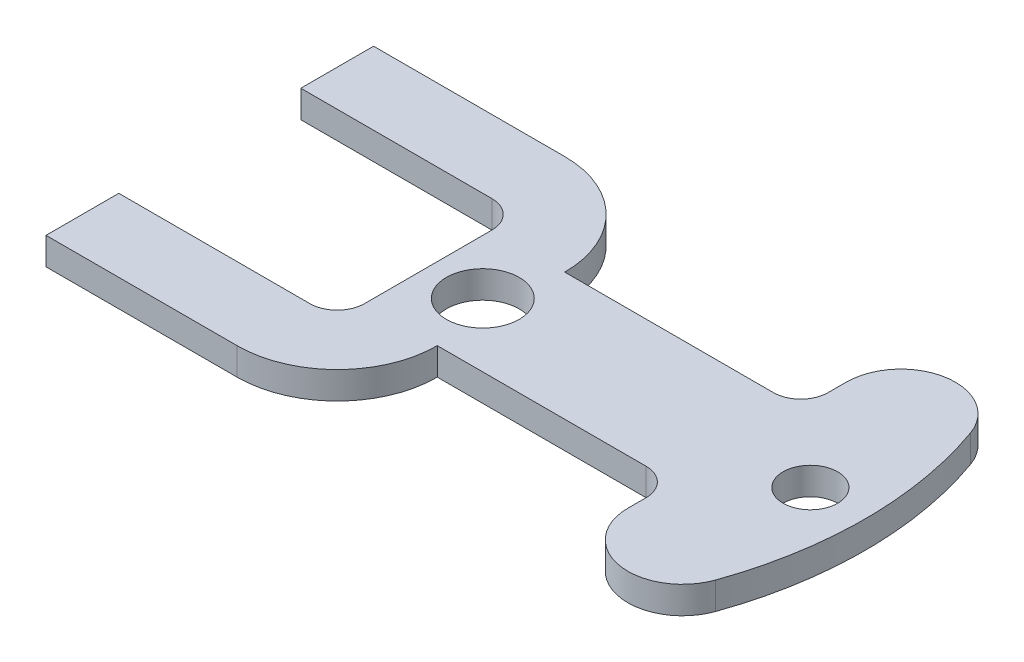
ISO-10303-21;
HEADER;
FILE_DESCRIPTION(('STEP AP214'),'2;1');
FILE_NAME('part.step','',(''),(''),'','','');
FILE_SCHEMA(('AUTOMOTIVE_DESIGN { 1 0 10303 214 1 1 1 1 }'));
ENDSEC;
DATA;
#1=APPLICATION_CONTEXT('core data for automotive mechanical design processes');
#2=APPLICATION_PROTOCOL_DEFINITION('international standard','automotive_design',2000,#1);
#3=PRODUCT_CONTEXT('',#1,'mechanical');
#4=PRODUCT('Part','Part','',(#3));
#5=PRODUCT_RELATED_PRODUCT_CATEGORY('part','',(#4));
#6=PRODUCT_DEFINITION_FORMATION('','',#4);
#7=PRODUCT_DEFINITION_CONTEXT('part definition',#1,'design');
#8=PRODUCT_DEFINITION('design','',#6,#7);
#9=PRODUCT_DEFINITION_SHAPE('','',#8);
#10=(LENGTH_UNIT() NAMED_UNIT(*) SI_UNIT(.MILLI.,.METRE.));
#11=(NAMED_UNIT(*) PLANE_ANGLE_UNIT() SI_UNIT($,.RADIAN.));
#12=(NAMED_UNIT(*) SI_UNIT($,.STERADIAN.) SOLID_ANGLE_UNIT());
#13=UNCERTAINTY_MEASURE_WITH_UNIT(LENGTH_MEASURE(1.E-05),#10,'distance_accuracy_value','');
#14=(GEOMETRIC_REPRESENTATION_CONTEXT(3) GLOBAL_UNCERTAINTY_ASSIGNED_CONTEXT((#13)) GLOBAL_UNIT_ASSIGNED_CONTEXT((#10,
#11,#12)) REPRESENTATION_CONTEXT('',''));
#15=CARTESIAN_POINT('',(0.,0.,0.));
#16=DIRECTION('',(0.,0.,1.));
#17=DIRECTION('',(1.,0.,0.));
#18=AXIS2_PLACEMENT_3D('',#15,#16,#17);
#19=CARTESIAN_POINT('',(24.9411254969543,3.,10.));
#20=DIRECTION('',(0.,-1.,0.));
#21=DIRECTION('',(0.,0.,-1.));
#22=AXIS2_PLACEMENT_3D('',#19,#20,#21);
#23=CYLINDRICAL_SURFACE('',#22,3.);
#24=CARTESIAN_POINT('',(24.9411254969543,0.,10.));
#25=DIRECTION('',(0.,1.,0.));
#26=DIRECTION('',(0.,0.,1.));
#27=AXIS2_PLACEMENT_3D('',#24,#25,#26);
#28=CIRCLE('',#27,3.);
#29=CARTESIAN_POINT('',(27.9411254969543,0.,10.));
#30=VERTEX_POINT('',#29);
#31=CARTESIAN_POINT('',(24.9411254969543,0.,7.));
#32=VERTEX_POINT('',#31);
#33=EDGE_CURVE('E205',#30,#32,#28,.T.);
#34=ORIENTED_EDGE('',*,*,#33,.F.);
#35=DIRECTION('',(0.,-1.,0.));
#36=VECTOR('',#35,1.);
#37=CARTESIAN_POINT('',(27.9411254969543,3.,10.));
#38=LINE('',#37,#36);
#39=CARTESIAN_POINT('',(27.9411254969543,3.,10.));
#40=VERTEX_POINT('',#39);
#41=EDGE_CURVE('E11',#40,#30,#38,.T.);
#42=ORIENTED_EDGE('',*,*,#41,.F.);
#43=CARTESIAN_POINT('',(24.9411254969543,3.,10.));
#44=DIRECTION('',(0.,1.,0.));
#45=DIRECTION('',(0.,0.,1.));
#46=AXIS2_PLACEMENT_3D('',#43,#44,#45);
#47=CIRCLE('',#46,3.);
#48=CARTESIAN_POINT('',(24.9411254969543,3.,7.));
#49=VERTEX_POINT('',#48);
#50=EDGE_CURVE('E257',#40,#49,#47,.T.);
#51=ORIENTED_EDGE('',*,*,#50,.T.);
#52=DIRECTION('',(0.,-1.,0.));
#53=VECTOR('',#52,1.);
#54=CARTESIAN_POINT('',(24.9411254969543,3.,7.));
#55=LINE('',#54,#53);
#56=EDGE_CURVE('E120',#49,#32,#55,.T.);
#57=ORIENTED_EDGE('',*,*,#56,.T.);
#58=EDGE_LOOP('',(#34,#42,#51,#57));
#59=FACE_BOUND('',#58,.T.);
#60=ADVANCED_FACE('F33',(#59),#23,.F.);
#61=CARTESIAN_POINT('',(27.9411254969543,3.,0.));
#62=DIRECTION('',(1.,0.,0.));
#63=DIRECTION('',(0.,0.,-1.));
#64=AXIS2_PLACEMENT_3D('',#61,#62,#63);
#65=PLANE('',#64);
#66=DIRECTION('',(0.,0.,1.));
#67=VECTOR('',#66,1.);
#68=CARTESIAN_POINT('',(27.9411254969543,0.,0.));
#69=LINE('',#68,#67);
#70=CARTESIAN_POINT('',(27.9411254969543,0.,12.));
#71=VERTEX_POINT('',#70);
#72=EDGE_CURVE('E208',#30,#71,#69,.T.);
#73=ORIENTED_EDGE('',*,*,#72,.T.);
#74=DIRECTION('',(0.,-1.,0.));
#75=VECTOR('',#74,1.);
#76=CARTESIAN_POINT('',(27.9411254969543,3.,12.));
#77=LINE('',#76,#75);
#78=CARTESIAN_POINT('',(27.9411254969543,3.,12.));
#79=VERTEX_POINT('',#78);
#80=EDGE_CURVE('E41',#79,#71,#77,.T.);
#81=ORIENTED_EDGE('',*,*,#80,.F.);
#82=DIRECTION('',(0.,0.,1.));
#83=VECTOR('',#82,1.);
#84=CARTESIAN_POINT('',(27.9411254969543,3.,0.));
#85=LINE('',#84,#83);
#86=EDGE_CURVE('E363',#40,#79,#85,.T.);
#87=ORIENTED_EDGE('',*,*,#86,.F.);
#88=ORIENTED_EDGE('',*,*,#41,.T.);
#89=EDGE_LOOP('',(#73,#81,#87,#88));
#90=FACE_BOUND('',#89,.T.);
#91=ADVANCED_FACE('F366',(#90),#65,.F.);
#92=CARTESIAN_POINT('',(33.9411254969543,3.,12.));
#93=DIRECTION('',(0.,-1.,0.));
#94=DIRECTION('',(0.,0.,-1.));
#95=AXIS2_PLACEMENT_3D('',#92,#93,#94);
#96=CYLINDRICAL_SURFACE('',#95,5.99999999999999);
#97=CARTESIAN_POINT('',(33.9411254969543,0.,12.));
#98=DIRECTION('',(0.,1.,0.));
#99=DIRECTION('',(0.,0.,1.));
#100=AXIS2_PLACEMENT_3D('',#97,#98,#99);
#101=CIRCLE('',#100,5.99999999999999);
#102=CARTESIAN_POINT('',(39.5979797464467,0.,14.));
#103=VERTEX_POINT('',#102);
#104=EDGE_CURVE('E210',#71,#103,#101,.T.);
#105=ORIENTED_EDGE('',*,*,#104,.T.);
#106=DIRECTION('',(0.,-1.,0.));
#107=VECTOR('',#106,1.);
#108=CARTESIAN_POINT('',(39.5979797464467,3.,14.));
#109=LINE('',#108,#107);
#110=CARTESIAN_POINT('',(39.5979797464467,3.,14.));
#111=VERTEX_POINT('',#110);
#112=EDGE_CURVE('E293',#111,#103,#109,.T.);
#113=ORIENTED_EDGE('',*,*,#112,.F.);
#114=CARTESIAN_POINT('',(33.9411254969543,3.,12.));
#115=DIRECTION('',(0.,1.,0.));
#116=DIRECTION('',(0.,0.,1.));
#117=AXIS2_PLACEMENT_3D('',#114,#115,#116);
#118=CIRCLE('',#117,5.99999999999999);
#119=EDGE_CURVE('E302',#79,#111,#118,.T.);
#120=ORIENTED_EDGE('',*,*,#119,.F.);
#121=ORIENTED_EDGE('',*,*,#80,.T.);
#122=EDGE_LOOP('',(#105,#113,#120,#121));
#123=FACE_BOUND('',#122,.T.);
#124=ADVANCED_FACE('F300',(#123),#96,.T.);
#125=CARTESIAN_POINT('',(0.,3.,0.));
#126=DIRECTION('',(0.,-1.,0.));
#127=DIRECTION('',(0.,0.,-1.));
#128=AXIS2_PLACEMENT_3D('',#125,#126,#127);
#129=CYLINDRICAL_SURFACE('',#128,42.);
#130=CARTESIAN_POINT('',(0.,0.,0.));
#131=DIRECTION('',(0.,1.,0.));
#132=DIRECTION('',(0.,0.,1.));
#133=AXIS2_PLACEMENT_3D('',#130,#131,#132);
#134=CIRCLE('',#133,42.);
#135=CARTESIAN_POINT('',(39.5979797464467,0.,-14.));
#136=VERTEX_POINT('',#135);
#137=EDGE_CURVE('E212',#103,#136,#134,.T.);
#138=ORIENTED_EDGE('',*,*,#137,.T.);
#139=DIRECTION('',(0.,-1.,0.));
#140=VECTOR('',#139,1.);
#141=CARTESIAN_POINT('',(39.5979797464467,3.,-14.));
#142=LINE('',#141,#140);
#143=CARTESIAN_POINT('',(39.5979797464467,3.,-14.));
#144=VERTEX_POINT('',#143);
#145=EDGE_CURVE('E290',#144,#136,#142,.T.);
#146=ORIENTED_EDGE('',*,*,#145,.F.);
#147=CARTESIAN_POINT('',(0.,3.,0.));
#148=DIRECTION('',(0.,1.,0.));
#149=DIRECTION('',(0.,0.,1.));
#150=AXIS2_PLACEMENT_3D('',#147,#148,#149);
#151=CIRCLE('',#150,42.);
#152=EDGE_CURVE('E322',#111,#144,#151,.T.);
#153=ORIENTED_EDGE('',*,*,#152,.F.);
#154=ORIENTED_EDGE('',*,*,#112,.T.);
#155=EDGE_LOOP('',(#138,#146,#153,#154));
#156=FACE_BOUND('',#155,.T.);
#157=ADVANCED_FACE('F313',(#156),#129,.T.);
#158=CARTESIAN_POINT('',(33.9411254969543,3.,-12.));
#159=DIRECTION('',(0.,-1.,0.));
#160=DIRECTION('',(0.,0.,-1.));
#161=AXIS2_PLACEMENT_3D('',#158,#159,#160);
#162=CYLINDRICAL_SURFACE('',#161,5.99999999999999);
#163=CARTESIAN_POINT('',(33.9411254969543,0.,-12.));
#164=DIRECTION('',(0.,1.,0.));
#165=DIRECTION('',(0.,0.,1.));
#166=AXIS2_PLACEMENT_3D('',#163,#164,#165);
#167=CIRCLE('',#166,5.99999999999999);
#168=CARTESIAN_POINT('',(27.9411254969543,0.,-12.));
#169=VERTEX_POINT('',#168);
#170=EDGE_CURVE('E214',#136,#169,#167,.T.);
#171=ORIENTED_EDGE('',*,*,#170,.T.);
#172=DIRECTION('',(0.,-1.,0.));
#173=VECTOR('',#172,1.);
#174=CARTESIAN_POINT('',(27.9411254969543,3.,-12.));
#175=LINE('',#174,#173);
#176=CARTESIAN_POINT('',(27.9411254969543,3.,-12.));
#177=VERTEX_POINT('',#176);
#178=EDGE_CURVE('E287',#177,#169,#175,.T.);
#179=ORIENTED_EDGE('',*,*,#178,.F.);
#180=CARTESIAN_POINT('',(33.9411254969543,3.,-12.));
#181=DIRECTION('',(0.,1.,0.));
#182=DIRECTION('',(0.,0.,1.));
#183=AXIS2_PLACEMENT_3D('',#180,#181,#182);
#184=CIRCLE('',#183,5.99999999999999);
#185=EDGE_CURVE('E319',#144,#177,#184,.T.);
#186=ORIENTED_EDGE('',*,*,#185,.F.);
#187=ORIENTED_EDGE('',*,*,#145,.T.);
#188=EDGE_LOOP('',(#171,#179,#186,#187));
#189=FACE_BOUND('',#188,.T.);
#190=ADVANCED_FACE('F317',(#189),#162,.T.);
#191=CARTESIAN_POINT('',(27.9411254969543,3.,0.));
#192=DIRECTION('',(1.,0.,0.));
#193=DIRECTION('',(0.,0.,-1.));
#194=AXIS2_PLACEMENT_3D('',#191,#192,#193);
#195=PLANE('',#194);
#196=DIRECTION('',(0.,0.,1.));
#197=VECTOR('',#196,1.);
#198=CARTESIAN_POINT('',(27.9411254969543,0.,0.));
#199=LINE('',#198,#197);
#200=CARTESIAN_POINT('',(27.9411254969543,0.,-10.));
#201=VERTEX_POINT('',#200);
#202=EDGE_CURVE('E216',#169,#201,#199,.T.);
#203=ORIENTED_EDGE('',*,*,#202,.T.);
#204=DIRECTION('',(0.,-1.,0.));
#205=VECTOR('',#204,1.);
#206=CARTESIAN_POINT('',(27.9411254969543,3.,-10.));
#207=LINE('',#206,#205);
#208=CARTESIAN_POINT('',(27.9411254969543,3.,-10.));
#209=VERTEX_POINT('',#208);
#210=EDGE_CURVE('E285',#209,#201,#207,.T.);
#211=ORIENTED_EDGE('',*,*,#210,.F.);
#212=DIRECTION('',(0.,0.,1.));
#213=VECTOR('',#212,1.);
#214=CARTESIAN_POINT('',(27.9411254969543,3.,0.));
#215=LINE('',#214,#213);
#216=EDGE_CURVE('E321',#177,#209,#215,.T.);
#217=ORIENTED_EDGE('',*,*,#216,.F.);
#218=ORIENTED_EDGE('',*,*,#178,.T.);
#219=EDGE_LOOP('',(#203,#211,#217,#218));
#220=FACE_BOUND('',#219,.T.);
#221=ADVANCED_FACE('F378',(#220),#195,.F.);
#222=CARTESIAN_POINT('',(24.9411254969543,3.,-10.));
#223=DIRECTION('',(0.,-1.,0.));
#224=DIRECTION('',(0.,0.,-1.));
#225=AXIS2_PLACEMENT_3D('',#222,#223,#224);
#226=CYLINDRICAL_SURFACE('',#225,3.);
#227=CARTESIAN_POINT('',(24.9411254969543,0.,-10.));
#228=DIRECTION('',(0.,1.,0.));
#229=DIRECTION('',(0.,0.,1.));
#230=AXIS2_PLACEMENT_3D('',#227,#228,#229);
#231=CIRCLE('',#230,3.);
#232=CARTESIAN_POINT('',(24.9411254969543,0.,-7.));
#233=VERTEX_POINT('',#232);
#234=EDGE_CURVE('E219',#233,#201,#231,.T.);
#235=ORIENTED_EDGE('',*,*,#234,.F.);
#236=DIRECTION('',(0.,-1.,0.));
#237=VECTOR('',#236,1.);
#238=CARTESIAN_POINT('',(24.9411254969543,3.,-7.));
#239=LINE('',#238,#237);
#240=CARTESIAN_POINT('',(24.9411254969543,3.,-7.));
#241=VERTEX_POINT('',#240);
#242=EDGE_CURVE('E283',#241,#233,#239,.T.);
#243=ORIENTED_EDGE('',*,*,#242,.F.);
#244=CARTESIAN_POINT('',(24.9411254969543,3.,-10.));
#245=DIRECTION('',(0.,1.,0.));
#246=DIRECTION('',(0.,0.,1.));
#247=AXIS2_PLACEMENT_3D('',#244,#245,#246);
#248=CIRCLE('',#247,3.);
#249=EDGE_CURVE('E324',#241,#209,#248,.T.);
#250=ORIENTED_EDGE('',*,*,#249,.T.);
#251=ORIENTED_EDGE('',*,*,#210,.T.);
#252=EDGE_LOOP('',(#235,#243,#250,#251));
#253=FACE_BOUND('',#252,.T.);
#254=ADVANCED_FACE('F381',(#253),#226,.F.);
#255=CARTESIAN_POINT('',(-56.7545190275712,3.,-7.));
#256=DIRECTION('',(0.,0.,-1.));
#257=DIRECTION('',(-1.,0.,0.));
#258=AXIS2_PLACEMENT_3D('',#255,#256,#257);
#259=PLANE('',#258);
#260=DIRECTION('',(1.,0.,0.));
#261=VECTOR('',#260,1.);
#262=CARTESIAN_POINT('',(-56.7545190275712,0.,-7.));
#263=LINE('',#262,#261);
#264=CARTESIAN_POINT('',(2.00000000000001,0.,-7.));
#265=VERTEX_POINT('',#264);
#266=EDGE_CURVE('E222',#265,#233,#263,.T.);
#267=ORIENTED_EDGE('',*,*,#266,.F.);
#268=DIRECTION('',(0.,-1.,0.));
#269=VECTOR('',#268,1.);
#270=CARTESIAN_POINT('',(2.00000000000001,3.,-7.));
#271=LINE('',#270,#269);
#272=CARTESIAN_POINT('',(2.00000000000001,3.,-7.));
#273=VERTEX_POINT('',#272);
#274=EDGE_CURVE('E281',#273,#265,#271,.T.);
#275=ORIENTED_EDGE('',*,*,#274,.F.);
#276=DIRECTION('',(1.,0.,0.));
#277=VECTOR('',#276,1.);
#278=CARTESIAN_POINT('',(-56.7545190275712,3.,-7.));
#279=LINE('',#278,#277);
#280=EDGE_CURVE('E331',#273,#241,#279,.T.);
#281=ORIENTED_EDGE('',*,*,#280,.T.);
#282=ORIENTED_EDGE('',*,*,#242,.T.);
#283=EDGE_LOOP('',(#267,#275,#281,#282));
#284=FACE_BOUND('',#283,.T.);
#285=ADVANCED_FACE('F385',(#284),#259,.T.);
#286=CARTESIAN_POINT('',(-9.,3.,-7.));
#287=DIRECTION('',(0.,-1.,0.));
#288=DIRECTION('',(0.,0.,-1.));
#289=AXIS2_PLACEMENT_3D('',#286,#287,#288);
#290=CYLINDRICAL_SURFACE('',#289,11.);
#291=CARTESIAN_POINT('',(-9.,0.,-7.));
#292=DIRECTION('',(0.,1.,0.));
#293=DIRECTION('',(0.,0.,1.));
#294=AXIS2_PLACEMENT_3D('',#291,#292,#293);
#295=CIRCLE('',#294,11.);
#296=CARTESIAN_POINT('',(-9.,0.,-18.));
#297=VERTEX_POINT('',#296);
#298=EDGE_CURVE('E225',#265,#297,#295,.T.);
#299=ORIENTED_EDGE('',*,*,#298,.T.);
#300=DIRECTION('',(0.,-1.,0.));
#301=VECTOR('',#300,1.);
#302=CARTESIAN_POINT('',(-9.,3.,-18.));
#303=LINE('',#302,#301);
#304=CARTESIAN_POINT('',(-9.,3.,-18.));
#305=VERTEX_POINT('',#304);
#306=EDGE_CURVE('E278',#305,#297,#303,.T.);
#307=ORIENTED_EDGE('',*,*,#306,.F.);
#308=CARTESIAN_POINT('',(-9.,3.,-7.));
#309=DIRECTION('',(0.,1.,0.));
#310=DIRECTION('',(0.,0.,1.));
#311=AXIS2_PLACEMENT_3D('',#308,#309,#310);
#312=CIRCLE('',#311,11.);
#313=EDGE_CURVE('E334',#273,#305,#312,.T.);
#314=ORIENTED_EDGE('',*,*,#313,.F.);
#315=ORIENTED_EDGE('',*,*,#274,.T.);
#316=EDGE_LOOP('',(#299,#307,#314,#315));
#317=FACE_BOUND('',#316,.T.);
#318=ADVANCED_FACE('F389',(#317),#290,.T.);
#319=CARTESIAN_POINT('',(-56.7545190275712,3.,-18.));
#320=DIRECTION('',(0.,0.,1.));
#321=DIRECTION('',(1.,0.,0.));
#322=AXIS2_PLACEMENT_3D('',#319,#320,#321);
#323=PLANE('',#322);
#324=DIRECTION('',(-1.,0.,0.));
#325=VECTOR('',#324,1.);
#326=CARTESIAN_POINT('',(-56.7545190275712,0.,-18.));
#327=LINE('',#326,#325);
#328=CARTESIAN_POINT('',(-30.,0.,-18.));
#329=VERTEX_POINT('',#328);
#330=EDGE_CURVE('E227',#297,#329,#327,.T.);
#331=ORIENTED_EDGE('',*,*,#330,.T.);
#332=DIRECTION('',(0.,-1.,0.));
#333=VECTOR('',#332,1.);
#334=CARTESIAN_POINT('',(-30.,3.,-18.));
#335=LINE('',#334,#333);
#336=CARTESIAN_POINT('',(-30.,3.,-18.));
#337=VERTEX_POINT('',#336);
#338=EDGE_CURVE('E275',#337,#329,#335,.T.);
#339=ORIENTED_EDGE('',*,*,#338,.F.);
#340=DIRECTION('',(-1.,0.,0.));
#341=VECTOR('',#340,1.);
#342=CARTESIAN_POINT('',(-56.7545190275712,3.,-18.));
#343=LINE('',#342,#341);
#344=EDGE_CURVE('E336',#305,#337,#343,.T.);
#345=ORIENTED_EDGE('',*,*,#344,.F.);
#346=ORIENTED_EDGE('',*,*,#306,.T.);
#347=EDGE_LOOP('',(#331,#339,#345,#346));
#348=FACE_BOUND('',#347,.T.);
#349=ADVANCED_FACE('F393',(#348),#323,.F.);
#350=CARTESIAN_POINT('',(-30.,3.,0.));
#351=DIRECTION('',(1.,0.,0.));
#352=DIRECTION('',(0.,0.,-1.));
#353=AXIS2_PLACEMENT_3D('',#350,#351,#352);
#354=PLANE('',#353);
#355=DIRECTION('',(0.,0.,1.));
#356=VECTOR('',#355,1.);
#357=CARTESIAN_POINT('',(-30.,0.,0.));
#358=LINE('',#357,#356);
#359=CARTESIAN_POINT('',(-30.,0.,-10.));
#360=VERTEX_POINT('',#359);
#361=EDGE_CURVE('E229',#329,#360,#358,.T.);
#362=ORIENTED_EDGE('',*,*,#361,.T.);
#363=DIRECTION('',(0.,-1.,0.));
#364=VECTOR('',#363,1.);
#365=CARTESIAN_POINT('',(-30.,3.,-10.));
#366=LINE('',#365,#364);
#367=CARTESIAN_POINT('',(-30.,3.,-10.));
#368=VERTEX_POINT('',#367);
#369=EDGE_CURVE('E272',#368,#360,#366,.T.);
#370=ORIENTED_EDGE('',*,*,#369,.F.);
#371=DIRECTION('',(0.,0.,1.));
#372=VECTOR('',#371,1.);
#373=CARTESIAN_POINT('',(-30.,3.,0.));
#374=LINE('',#373,#372);
#375=EDGE_CURVE('E338',#337,#368,#374,.T.);
#376=ORIENTED_EDGE('',*,*,#375,.F.);
#377=ORIENTED_EDGE('',*,*,#338,.T.);
#378=EDGE_LOOP('',(#362,#370,#376,#377));
#379=FACE_BOUND('',#378,.T.);
#380=ADVANCED_FACE('F397',(#379),#354,.F.);
#381=CARTESIAN_POINT('',(-56.7545190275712,3.,-10.));
#382=DIRECTION('',(0.,0.,-1.));
#383=DIRECTION('',(-1.,0.,0.));
#384=AXIS2_PLACEMENT_3D('',#381,#382,#383);
#385=PLANE('',#384);
#386=DIRECTION('',(1.,0.,0.));
#387=VECTOR('',#386,1.);
#388=CARTESIAN_POINT('',(-56.7545190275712,0.,-10.));
#389=LINE('',#388,#387);
#390=CARTESIAN_POINT('',(-9.00000000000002,0.,-10.));
#391=VERTEX_POINT('',#390);
#392=EDGE_CURVE('E231',#360,#391,#389,.T.);
#393=ORIENTED_EDGE('',*,*,#392,.T.);
#394=DIRECTION('',(0.,-1.,0.));
#395=VECTOR('',#394,1.);
#396=CARTESIAN_POINT('',(-9.00000000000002,3.,-10.));
#397=LINE('',#396,#395);
#398=CARTESIAN_POINT('',(-9.00000000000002,3.,-10.));
#399=VERTEX_POINT('',#398);
#400=EDGE_CURVE('E270',#399,#391,#397,.T.);
#401=ORIENTED_EDGE('',*,*,#400,.F.);
#402=DIRECTION('',(1.,0.,0.));
#403=VECTOR('',#402,1.);
#404=CARTESIAN_POINT('',(-56.7545190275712,3.,-10.));
#405=LINE('',#404,#403);
#406=EDGE_CURVE('E340',#368,#399,#405,.T.);
#407=ORIENTED_EDGE('',*,*,#406,.F.);
#408=ORIENTED_EDGE('',*,*,#369,.T.);
#409=EDGE_LOOP('',(#393,#401,#407,#408));
#410=FACE_BOUND('',#409,.T.);
#411=ADVANCED_FACE('F401',(#410),#385,.F.);
#412=CARTESIAN_POINT('',(-9.,3.,-7.));
#413=DIRECTION('',(0.,-1.,0.));
#414=DIRECTION('',(0.,0.,-1.));
#415=AXIS2_PLACEMENT_3D('',#412,#413,#414);
#416=CYLINDRICAL_SURFACE('',#415,3.);
#417=CARTESIAN_POINT('',(-9.,0.,-7.));
#418=DIRECTION('',(0.,1.,0.));
#419=DIRECTION('',(0.,0.,1.));
#420=AXIS2_PLACEMENT_3D('',#417,#418,#419);
#421=CIRCLE('',#420,3.);
#422=CARTESIAN_POINT('',(-6.,0.,-6.99999999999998));
#423=VERTEX_POINT('',#422);
#424=EDGE_CURVE('E234',#423,#391,#421,.T.);
#425=ORIENTED_EDGE('',*,*,#424,.F.);
#426=DIRECTION('',(0.,-1.,0.));
#427=VECTOR('',#426,1.);
#428=CARTESIAN_POINT('',(-6.,3.,-6.99999999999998));
#429=LINE('',#428,#427);
#430=CARTESIAN_POINT('',(-6.,3.,-6.99999999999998));
#431=VERTEX_POINT('',#430);
#432=EDGE_CURVE('E268',#431,#423,#429,.T.);
#433=ORIENTED_EDGE('',*,*,#432,.F.);
#434=CARTESIAN_POINT('',(-9.,3.,-7.));
#435=DIRECTION('',(0.,1.,0.));
#436=DIRECTION('',(0.,0.,1.));
#437=AXIS2_PLACEMENT_3D('',#434,#435,#436);
#438=CIRCLE('',#437,3.);
#439=EDGE_CURVE('E342',#431,#399,#438,.T.);
#440=ORIENTED_EDGE('',*,*,#439,.T.);
#441=ORIENTED_EDGE('',*,*,#400,.T.);
#442=EDGE_LOOP('',(#425,#433,#440,#441));
#443=FACE_BOUND('',#442,.T.);
#444=ADVANCED_FACE('F405',(#443),#416,.F.);
#445=CARTESIAN_POINT('',(-6.,3.,0.));
#446=DIRECTION('',(1.,0.,0.));
#447=DIRECTION('',(0.,0.,-1.));
#448=AXIS2_PLACEMENT_3D('',#445,#446,#447);
#449=PLANE('',#448);
#450=DIRECTION('',(0.,0.,1.));
#451=VECTOR('',#450,1.);
#452=CARTESIAN_POINT('',(-6.,0.,0.));
#453=LINE('',#452,#451);
#454=CARTESIAN_POINT('',(-6.,0.,6.99999999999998));
#455=VERTEX_POINT('',#454);
#456=EDGE_CURVE('E237',#423,#455,#453,.T.);
#457=ORIENTED_EDGE('',*,*,#456,.T.);
#458=DIRECTION('',(0.,-1.,0.));
#459=VECTOR('',#458,1.);
#460=CARTESIAN_POINT('',(-6.,3.,6.99999999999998));
#461=LINE('',#460,#459);
#462=CARTESIAN_POINT('',(-6.,3.,6.99999999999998));
#463=VERTEX_POINT('',#462);
#464=EDGE_CURVE('E266',#463,#455,#461,.T.);
#465=ORIENTED_EDGE('',*,*,#464,.F.);
#466=DIRECTION('',(0.,0.,1.));
#467=VECTOR('',#466,1.);
#468=CARTESIAN_POINT('',(-6.,3.,0.));
#469=LINE('',#468,#467);
#470=EDGE_CURVE('E345',#431,#463,#469,.T.);
#471=ORIENTED_EDGE('',*,*,#470,.F.);
#472=ORIENTED_EDGE('',*,*,#432,.T.);
#473=EDGE_LOOP('',(#457,#465,#471,#472));
#474=FACE_BOUND('',#473,.T.);
#475=ADVANCED_FACE('F409',(#474),#449,.F.);
#476=CARTESIAN_POINT('',(-9.,3.,7.));
#477=DIRECTION('',(0.,-1.,0.));
#478=DIRECTION('',(0.,0.,-1.));
#479=AXIS2_PLACEMENT_3D('',#476,#477,#478);
#480=CYLINDRICAL_SURFACE('',#479,3.);
#481=CARTESIAN_POINT('',(-9.,0.,7.));
#482=DIRECTION('',(0.,1.,0.));
#483=DIRECTION('',(0.,0.,1.));
#484=AXIS2_PLACEMENT_3D('',#481,#482,#483);
#485=CIRCLE('',#484,3.);
#486=CARTESIAN_POINT('',(-9.00000000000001,0.,10.));
#487=VERTEX_POINT('',#486);
#488=EDGE_CURVE('E240',#487,#455,#485,.T.);
#489=ORIENTED_EDGE('',*,*,#488,.F.);
#490=DIRECTION('',(0.,-1.,0.));
#491=VECTOR('',#490,1.);
#492=CARTESIAN_POINT('',(-9.00000000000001,3.,10.));
#493=LINE('',#492,#491);
#494=CARTESIAN_POINT('',(-9.00000000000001,3.,10.));
#495=VERTEX_POINT('',#494);
#496=EDGE_CURVE('E264',#495,#487,#493,.T.);
#497=ORIENTED_EDGE('',*,*,#496,.F.);
#498=CARTESIAN_POINT('',(-9.,3.,7.));
#499=DIRECTION('',(0.,1.,0.));
#500=DIRECTION('',(0.,0.,1.));
#501=AXIS2_PLACEMENT_3D('',#498,#499,#500);
#502=CIRCLE('',#501,3.);
#503=EDGE_CURVE('E347',#495,#463,#502,.T.);
#504=ORIENTED_EDGE('',*,*,#503,.T.);
#505=ORIENTED_EDGE('',*,*,#464,.T.);
#506=EDGE_LOOP('',(#489,#497,#504,#505));
#507=FACE_BOUND('',#506,.T.);
#508=ADVANCED_FACE('F413',(#507),#480,.F.);
#509=CARTESIAN_POINT('',(-56.7545190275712,3.,10.));
#510=DIRECTION('',(0.,0.,1.));
#511=DIRECTION('',(1.,0.,0.));
#512=AXIS2_PLACEMENT_3D('',#509,#510,#511);
#513=PLANE('',#512);
#514=DIRECTION('',(-1.,0.,0.));
#515=VECTOR('',#514,1.);
#516=CARTESIAN_POINT('',(-56.7545190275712,0.,10.));
#517=LINE('',#516,#515);
#518=CARTESIAN_POINT('',(-30.,0.,10.));
#519=VERTEX_POINT('',#518);
#520=EDGE_CURVE('E243',#487,#519,#517,.T.);
#521=ORIENTED_EDGE('',*,*,#520,.T.);
#522=DIRECTION('',(0.,-1.,0.));
#523=VECTOR('',#522,1.);
#524=CARTESIAN_POINT('',(-30.,3.,10.));
#525=LINE('',#524,#523);
#526=CARTESIAN_POINT('',(-30.,3.,10.));
#527=VERTEX_POINT('',#526);
#528=EDGE_CURVE('E261',#527,#519,#525,.T.);
#529=ORIENTED_EDGE('',*,*,#528,.F.);
#530=DIRECTION('',(-1.,0.,0.));
#531=VECTOR('',#530,1.);
#532=CARTESIAN_POINT('',(-56.7545190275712,3.,10.));
#533=LINE('',#532,#531);
#534=EDGE_CURVE('E350',#495,#527,#533,.T.);
#535=ORIENTED_EDGE('',*,*,#534,.F.);
#536=ORIENTED_EDGE('',*,*,#496,.T.);
#537=EDGE_LOOP('',(#521,#529,#535,#536));
#538=FACE_BOUND('',#537,.T.);
#539=ADVANCED_FACE('F355',(#538),#513,.F.);
#540=CARTESIAN_POINT('',(-30.,3.,0.));
#541=DIRECTION('',(1.,0.,0.));
#542=DIRECTION('',(0.,0.,-1.));
#543=AXIS2_PLACEMENT_3D('',#540,#541,#542);
#544=PLANE('',#543);
#545=DIRECTION('',(0.,0.,1.));
#546=VECTOR('',#545,1.);
#547=CARTESIAN_POINT('',(-30.,0.,0.));
#548=LINE('',#547,#546);
#549=CARTESIAN_POINT('',(-30.,0.,18.));
#550=VERTEX_POINT('',#549);
#551=EDGE_CURVE('E245',#519,#550,#548,.T.);
#552=ORIENTED_EDGE('',*,*,#551,.T.);
#553=DIRECTION('',(0.,-1.,0.));
#554=VECTOR('',#553,1.);
#555=CARTESIAN_POINT('',(-30.,3.,18.));
#556=LINE('',#555,#554);
#557=CARTESIAN_POINT('',(-30.,3.,18.));
#558=VERTEX_POINT('',#557);
#559=EDGE_CURVE('E191',#558,#550,#556,.T.);
#560=ORIENTED_EDGE('',*,*,#559,.F.);
#561=DIRECTION('',(0.,0.,1.));
#562=VECTOR('',#561,1.);
#563=CARTESIAN_POINT('',(-30.,3.,0.));
#564=LINE('',#563,#562);
#565=EDGE_CURVE('E182',#527,#558,#564,.T.);
#566=ORIENTED_EDGE('',*,*,#565,.F.);
#567=ORIENTED_EDGE('',*,*,#528,.T.);
#568=EDGE_LOOP('',(#552,#560,#566,#567));
#569=FACE_BOUND('',#568,.T.);
#570=ADVANCED_FACE('F359',(#569),#544,.F.);
#571=CARTESIAN_POINT('',(-56.7545190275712,3.,18.));
#572=DIRECTION('',(0.,0.,-1.));
#573=DIRECTION('',(-1.,0.,0.));
#574=AXIS2_PLACEMENT_3D('',#571,#572,#573);
#575=PLANE('',#574);
#576=DIRECTION('',(1.,0.,0.));
#577=VECTOR('',#576,1.);
#578=CARTESIAN_POINT('',(-56.7545190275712,0.,18.));
#579=LINE('',#578,#577);
#580=CARTESIAN_POINT('',(-9.,0.,18.));
#581=VERTEX_POINT('',#580);
#582=EDGE_CURVE('E190',#550,#581,#579,.T.);
#583=ORIENTED_EDGE('',*,*,#582,.T.);
#584=DIRECTION('',(0.,-1.,0.));
#585=VECTOR('',#584,1.);
#586=CARTESIAN_POINT('',(-9.,3.,18.));
#587=LINE('',#586,#585);
#588=CARTESIAN_POINT('',(-9.,3.,18.));
#589=VERTEX_POINT('',#588);
#590=EDGE_CURVE('E187',#589,#581,#587,.T.);
#591=ORIENTED_EDGE('',*,*,#590,.F.);
#592=DIRECTION('',(1.,0.,0.));
#593=VECTOR('',#592,1.);
#594=CARTESIAN_POINT('',(-56.7545190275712,3.,18.));
#595=LINE('',#594,#593);
#596=EDGE_CURVE('E175',#558,#589,#595,.T.);
#597=ORIENTED_EDGE('',*,*,#596,.F.);
#598=ORIENTED_EDGE('',*,*,#559,.T.);
#599=EDGE_LOOP('',(#583,#591,#597,#598));
#600=FACE_BOUND('',#599,.T.);
#601=ADVANCED_FACE('F188',(#600),#575,.F.);
#602=CARTESIAN_POINT('',(-9.,3.,7.));
#603=DIRECTION('',(0.,-1.,0.));
#604=DIRECTION('',(0.,0.,-1.));
#605=AXIS2_PLACEMENT_3D('',#602,#603,#604);
#606=CYLINDRICAL_SURFACE('',#605,11.);
#607=CARTESIAN_POINT('',(-9.,0.,7.));
#608=DIRECTION('',(0.,1.,0.));
#609=DIRECTION('',(0.,0.,1.));
#610=AXIS2_PLACEMENT_3D('',#607,#608,#609);
#611=CIRCLE('',#610,11.);
#612=CARTESIAN_POINT('',(2.00000000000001,0.,7.));
#613=VERTEX_POINT('',#612);
#614=EDGE_CURVE('E113',#581,#613,#611,.T.);
#615=ORIENTED_EDGE('',*,*,#614,.T.);
#616=DIRECTION('',(0.,-1.,0.));
#617=VECTOR('',#616,1.);
#618=CARTESIAN_POINT('',(2.00000000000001,3.,7.));
#619=LINE('',#618,#617);
#620=CARTESIAN_POINT('',(2.00000000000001,3.,7.));
#621=VERTEX_POINT('',#620);
#622=EDGE_CURVE('E192',#621,#613,#619,.T.);
#623=ORIENTED_EDGE('',*,*,#622,.F.);
#624=CARTESIAN_POINT('',(-9.,3.,7.));
#625=DIRECTION('',(0.,1.,0.));
#626=DIRECTION('',(0.,0.,1.));
#627=AXIS2_PLACEMENT_3D('',#624,#625,#626);
#628=CIRCLE('',#627,11.);
#629=EDGE_CURVE('E180',#589,#621,#628,.T.);
#630=ORIENTED_EDGE('',*,*,#629,.F.);
#631=ORIENTED_EDGE('',*,*,#590,.T.);
#632=EDGE_LOOP('',(#615,#623,#630,#631));
#633=FACE_BOUND('',#632,.T.);
#634=ADVANCED_FACE('F194',(#633),#606,.T.);
#635=CARTESIAN_POINT('',(36.,3.,0.));
#636=DIRECTION('',(0.,-1.,0.));
#637=DIRECTION('',(0.,0.,-1.));
#638=AXIS2_PLACEMENT_3D('',#635,#636,#637);
#639=CYLINDRICAL_SURFACE('',#638,3.00000000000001);
#640=CARTESIAN_POINT('',(36.,3.,0.));
#641=DIRECTION('',(0.,1.,0.));
#642=DIRECTION('',(0.,0.,1.));
#643=AXIS2_PLACEMENT_3D('',#640,#641,#642);
#644=CIRCLE('',#643,3.00000000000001);
#645=CARTESIAN_POINT('',(36.,3.,3.00000000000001));
#646=VERTEX_POINT('',#645);
#647=EDGE_CURVE('E196',#646,#646,#644,.T.);
#648=ORIENTED_EDGE('',*,*,#647,.T.);
#649=EDGE_LOOP('',(#648));
#650=FACE_BOUND('',#649,.T.);
#651=CARTESIAN_POINT('',(36.,0.,0.));
#652=DIRECTION('',(0.,1.,0.));
#653=DIRECTION('',(0.,0.,1.));
#654=AXIS2_PLACEMENT_3D('',#651,#652,#653);
#655=CIRCLE('',#654,3.00000000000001);
#656=CARTESIAN_POINT('',(36.,0.,3.00000000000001));
#657=VERTEX_POINT('',#656);
#658=EDGE_CURVE('E251',#657,#657,#655,.T.);
#659=ORIENTED_EDGE('',*,*,#658,.F.);
#660=EDGE_LOOP('',(#659));
#661=FACE_BOUND('',#660,.T.);
#662=ADVANCED_FACE('F426',(#650,#661),#639,.F.);
#663=CARTESIAN_POINT('',(-56.7545190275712,3.,7.));
#664=DIRECTION('',(0.,0.,-1.));
#665=DIRECTION('',(-1.,0.,0.));
#666=AXIS2_PLACEMENT_3D('',#663,#664,#665);
#667=PLANE('',#666);
#668=DIRECTION('',(1.,0.,0.));
#669=VECTOR('',#668,1.);
#670=CARTESIAN_POINT('',(-56.7545190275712,0.,7.));
#671=LINE('',#670,#669);
#672=EDGE_CURVE('E249',#613,#32,#671,.T.);
#673=ORIENTED_EDGE('',*,*,#672,.T.);
#674=ORIENTED_EDGE('',*,*,#56,.F.);
#675=DIRECTION('',(1.,0.,0.));
#676=VECTOR('',#675,1.);
#677=CARTESIAN_POINT('',(-56.7545190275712,3.,7.));
#678=LINE('',#677,#676);
#679=EDGE_CURVE('E49',#621,#49,#678,.T.);
#680=ORIENTED_EDGE('',*,*,#679,.F.);
#681=ORIENTED_EDGE('',*,*,#622,.T.);
#682=EDGE_LOOP('',(#673,#674,#680,#681));
#683=FACE_BOUND('',#682,.T.);
#684=ADVANCED_FACE('F362',(#683),#667,.F.);
#685=CARTESIAN_POINT('',(0.,3.,0.));
#686=DIRECTION('',(0.,-1.,0.));
#687=DIRECTION('',(0.,0.,-1.));
#688=AXIS2_PLACEMENT_3D('',#685,#686,#687);
#689=CYLINDRICAL_SURFACE('',#688,4.);
#690=CARTESIAN_POINT('',(0.,3.,0.));
#691=DIRECTION('',(0.,1.,0.));
#692=DIRECTION('',(0.,0.,1.));
#693=AXIS2_PLACEMENT_3D('',#690,#691,#692);
#694=CIRCLE('',#693,4.);
#695=CARTESIAN_POINT('',(0.,3.,4.));
#696=VERTEX_POINT('',#695);
#697=EDGE_CURVE('E202',#696,#696,#694,.T.);
#698=ORIENTED_EDGE('',*,*,#697,.T.);
#699=EDGE_LOOP('',(#698));
#700=FACE_BOUND('',#699,.T.);
#701=CARTESIAN_POINT('',(0.,0.,0.));
#702=DIRECTION('',(0.,1.,0.));
#703=DIRECTION('',(0.,0.,1.));
#704=AXIS2_PLACEMENT_3D('',#701,#702,#703);
#705=CIRCLE('',#704,4.);
#706=CARTESIAN_POINT('',(0.,0.,4.));
#707=VERTEX_POINT('',#706);
#708=EDGE_CURVE('E254',#707,#707,#705,.T.);
#709=ORIENTED_EDGE('',*,*,#708,.F.);
#710=EDGE_LOOP('',(#709));
#711=FACE_BOUND('',#710,.T.);
#712=ADVANCED_FACE('F429',(#700,#711),#689,.F.);
#713=CARTESIAN_POINT('',(-56.7545190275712,3.,0.));
#714=DIRECTION('',(0.,1.,0.));
#715=DIRECTION('',(0.,0.,1.));
#716=AXIS2_PLACEMENT_3D('',#713,#714,#715);
#717=PLANE('',#716);
#718=ORIENTED_EDGE('',*,*,#50,.F.);
#719=ORIENTED_EDGE('',*,*,#86,.T.);
#720=ORIENTED_EDGE('',*,*,#119,.T.);
#721=ORIENTED_EDGE('',*,*,#152,.T.);
#722=ORIENTED_EDGE('',*,*,#185,.T.);
#723=ORIENTED_EDGE('',*,*,#216,.T.);
#724=ORIENTED_EDGE('',*,*,#249,.F.);
#725=ORIENTED_EDGE('',*,*,#280,.F.);
#726=ORIENTED_EDGE('',*,*,#313,.T.);
#727=ORIENTED_EDGE('',*,*,#344,.T.);
#728=ORIENTED_EDGE('',*,*,#375,.T.);
#729=ORIENTED_EDGE('',*,*,#406,.T.);
#730=ORIENTED_EDGE('',*,*,#439,.F.);
#731=ORIENTED_EDGE('',*,*,#470,.T.);
#732=ORIENTED_EDGE('',*,*,#503,.F.);
#733=ORIENTED_EDGE('',*,*,#534,.T.);
#734=ORIENTED_EDGE('',*,*,#565,.T.);
#735=ORIENTED_EDGE('',*,*,#596,.T.);
#736=ORIENTED_EDGE('',*,*,#629,.T.);
#737=ORIENTED_EDGE('',*,*,#679,.T.);
#738=EDGE_LOOP('',(#718,#719,#720,#721,#722,#723,#724,#725,#726,#727,#728,#729,#730,#731,#732,
#733,#734,#735,#736,#737));
#739=FACE_BOUND('',#738,.T.);
#740=ORIENTED_EDGE('',*,*,#647,.F.);
#741=EDGE_LOOP('',(#740));
#742=FACE_BOUND('',#741,.T.);
#743=ORIENTED_EDGE('',*,*,#697,.F.);
#744=EDGE_LOOP('',(#743));
#745=FACE_BOUND('',#744,.T.);
#746=ADVANCED_FACE('F177',(#739,#742,#745),#717,.T.);
#747=CARTESIAN_POINT('',(-56.7545190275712,0.,0.));
#748=DIRECTION('',(0.,1.,0.));
#749=DIRECTION('',(0.,0.,1.));
#750=AXIS2_PLACEMENT_3D('',#747,#748,#749);
#751=PLANE('',#750);
#752=ORIENTED_EDGE('',*,*,#33,.T.);
#753=ORIENTED_EDGE('',*,*,#672,.F.);
#754=ORIENTED_EDGE('',*,*,#614,.F.);
#755=ORIENTED_EDGE('',*,*,#582,.F.);
#756=ORIENTED_EDGE('',*,*,#551,.F.);
#757=ORIENTED_EDGE('',*,*,#520,.F.);
#758=ORIENTED_EDGE('',*,*,#488,.T.);
#759=ORIENTED_EDGE('',*,*,#456,.F.);
#760=ORIENTED_EDGE('',*,*,#424,.T.);
#761=ORIENTED_EDGE('',*,*,#392,.F.);
#762=ORIENTED_EDGE('',*,*,#361,.F.);
#763=ORIENTED_EDGE('',*,*,#330,.F.);
#764=ORIENTED_EDGE('',*,*,#298,.F.);
#765=ORIENTED_EDGE('',*,*,#266,.T.);
#766=ORIENTED_EDGE('',*,*,#234,.T.);
#767=ORIENTED_EDGE('',*,*,#202,.F.);
#768=ORIENTED_EDGE('',*,*,#170,.F.);
#769=ORIENTED_EDGE('',*,*,#137,.F.);
#770=ORIENTED_EDGE('',*,*,#104,.F.);
#771=ORIENTED_EDGE('',*,*,#72,.F.);
#772=EDGE_LOOP('',(#752,#753,#754,#755,#756,#757,#758,#759,#760,#761,#762,#763,#764,#765,#766,
#767,#768,#769,#770,#771));
#773=FACE_BOUND('',#772,.T.);
#774=ORIENTED_EDGE('',*,*,#658,.T.);
#775=EDGE_LOOP('',(#774));
#776=FACE_BOUND('',#775,.T.);
#777=ORIENTED_EDGE('',*,*,#708,.T.);
#778=EDGE_LOOP('',(#777));
#779=FACE_BOUND('',#778,.T.);
#780=ADVANCED_FACE('F307',(#773,#776,#779),#751,.F.);
#781=CLOSED_SHELL('',(#60,#91,#124,#157,#190,#221,#254,#285,#318,#349,#380,#411,#444,#475,#508,
#539,#570,#601,#634,#662,#684,#712,#746,#780));
#782=MANIFOLD_SOLID_BREP('B2',#781);
#783=ADVANCED_BREP_SHAPE_REPRESENTATION('',(#18,#782),#14);
#784=SHAPE_DEFINITION_REPRESENTATION(#9,#783);
ENDSEC;
END-ISO-10303-21;
